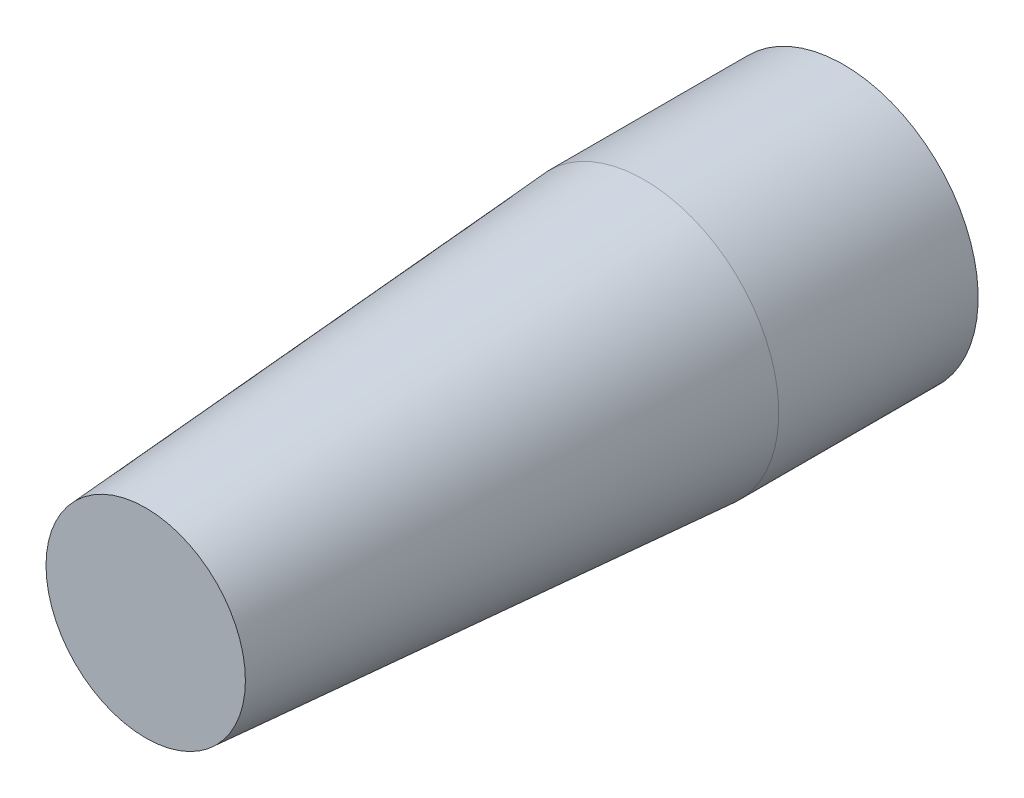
from build123d import *

# Parameters (mm, degrees)
SCHIZZO3_R                   = 13.5
ESTRUSIONE_ESTRUSIONE1_DEPTH = 20


with BuildPart() as part:
    # Schizzo2 → Rivoluzione1 (revolve)
    with BuildSketch(Plane(origin=(0, 0, 0), x_dir=(0, 0, -1), z_dir=(1, 0, 0)), mode=Mode.PRIVATE) as rivoluzione1_sk:
        Polygon((0, 0), (0, 13.5), (-50, 10), (-50, 0), align=None)
    revolve(rivoluzione1_sk.sketch.rotate(Axis((0, 0, 50), (0, 0, -1)), 90), axis=Axis((0, 0, 50), (0, 0, -1)))

    # Schizzo3 → Estrusione-Estrusione1 (add)
    with BuildSketch(Plane(origin=(0, 0, 0), x_dir=(-1, 0, 0), z_dir=(0, 0, -1))):
        Circle(SCHIZZO3_R)
    extrude(amount=ESTRUSIONE_ESTRUSIONE1_DEPTH)


solid = part.part
